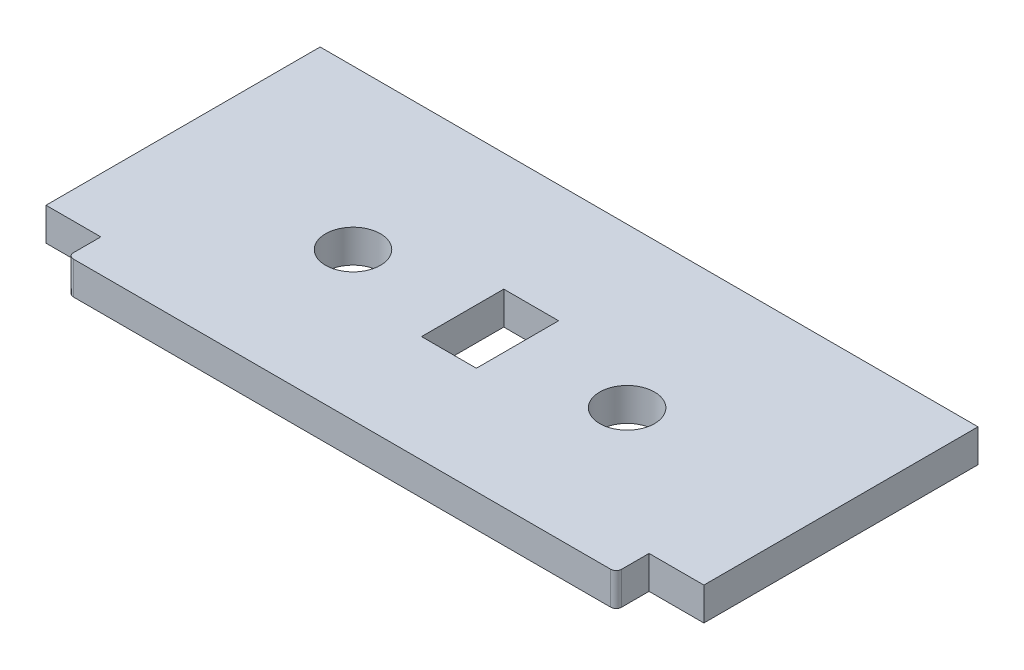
ISO-10303-21;
HEADER;
FILE_DESCRIPTION(('STEP AP214'),'2;1');
FILE_NAME('part.step','',(''),(''),'','','');
FILE_SCHEMA(('AUTOMOTIVE_DESIGN { 1 0 10303 214 1 1 1 1 }'));
ENDSEC;
DATA;
#1=APPLICATION_CONTEXT('core data for automotive mechanical design processes');
#2=APPLICATION_PROTOCOL_DEFINITION('international standard','automotive_design',2000,#1);
#3=PRODUCT_CONTEXT('',#1,'mechanical');
#4=PRODUCT('Part','Part','',(#3));
#5=PRODUCT_RELATED_PRODUCT_CATEGORY('part','',(#4));
#6=PRODUCT_DEFINITION_FORMATION('','',#4);
#7=PRODUCT_DEFINITION_CONTEXT('part definition',#1,'design');
#8=PRODUCT_DEFINITION('design','',#6,#7);
#9=PRODUCT_DEFINITION_SHAPE('','',#8);
#10=(LENGTH_UNIT() NAMED_UNIT(*) SI_UNIT(.MILLI.,.METRE.));
#11=(NAMED_UNIT(*) PLANE_ANGLE_UNIT() SI_UNIT($,.RADIAN.));
#12=(NAMED_UNIT(*) SI_UNIT($,.STERADIAN.) SOLID_ANGLE_UNIT());
#13=UNCERTAINTY_MEASURE_WITH_UNIT(LENGTH_MEASURE(1.E-05),#10,'distance_accuracy_value','');
#14=(GEOMETRIC_REPRESENTATION_CONTEXT(3) GLOBAL_UNCERTAINTY_ASSIGNED_CONTEXT((#13)) GLOBAL_UNIT_ASSIGNED_CONTEXT((#10,
#11,#12)) REPRESENTATION_CONTEXT('',''));
#15=CARTESIAN_POINT('',(0.,0.,0.));
#16=DIRECTION('',(0.,0.,1.));
#17=DIRECTION('',(1.,0.,0.));
#18=AXIS2_PLACEMENT_3D('',#15,#16,#17);
#19=CARTESIAN_POINT('',(0.,6.,0.));
#20=DIRECTION('',(0.,-1.,0.));
#21=DIRECTION('',(0.,0.,-1.));
#22=AXIS2_PLACEMENT_3D('',#19,#20,#21);
#23=PLANE('',#22);
#24=CARTESIAN_POINT('',(25.,6.,4.));
#25=DIRECTION('',(0.,1.,0.));
#26=DIRECTION('',(0.,0.,-1.));
#27=AXIS2_PLACEMENT_3D('',#24,#25,#26);
#28=CIRCLE('',#27,5.);
#29=CARTESIAN_POINT('',(25.,6.,-1.));
#30=VERTEX_POINT('',#29);
#31=EDGE_CURVE('E202',#30,#30,#28,.T.);
#32=ORIENTED_EDGE('',*,*,#31,.F.);
#33=EDGE_LOOP('',(#32));
#34=FACE_BOUND('',#33,.T.);
#35=CARTESIAN_POINT('',(-25.,6.,4.));
#36=DIRECTION('',(0.,1.,0.));
#37=DIRECTION('',(0.,0.,1.));
#38=AXIS2_PLACEMENT_3D('',#35,#36,#37);
#39=CIRCLE('',#38,5.);
#40=CARTESIAN_POINT('',(-25.,6.,9.));
#41=VERTEX_POINT('',#40);
#42=EDGE_CURVE('E210',#41,#41,#39,.T.);
#43=ORIENTED_EDGE('',*,*,#42,.F.);
#44=EDGE_LOOP('',(#43));
#45=FACE_BOUND('',#44,.T.);
#46=DIRECTION('',(0.,0.,1.));
#47=VECTOR('',#46,1.);
#48=CARTESIAN_POINT('',(-50.,6.,25.));
#49=LINE('',#48,#47);
#50=CARTESIAN_POINT('',(-50.,6.,25.));
#51=VERTEX_POINT('',#50);
#52=CARTESIAN_POINT('',(-50.,6.,30.));
#53=VERTEX_POINT('',#52);
#54=EDGE_CURVE('E235',#51,#53,#49,.T.);
#55=ORIENTED_EDGE('',*,*,#54,.T.);
#56=CARTESIAN_POINT('',(-49.,6.,30.));
#57=DIRECTION('',(0.,-1.,0.));
#58=DIRECTION('',(0.,0.,-1.));
#59=AXIS2_PLACEMENT_3D('',#56,#57,#58);
#60=CIRCLE('',#59,1.);
#61=CARTESIAN_POINT('',(-49.,6.,31.));
#62=VERTEX_POINT('',#61);
#63=EDGE_CURVE('E52',#53,#62,#60,.F.);
#64=ORIENTED_EDGE('',*,*,#63,.T.);
#65=DIRECTION('',(1.,0.,0.));
#66=VECTOR('',#65,1.);
#67=CARTESIAN_POINT('',(-50.,6.,31.));
#68=LINE('',#67,#66);
#69=CARTESIAN_POINT('',(49.,6.,31.));
#70=VERTEX_POINT('',#69);
#71=EDGE_CURVE('E238',#62,#70,#68,.T.);
#72=ORIENTED_EDGE('',*,*,#71,.T.);
#73=CARTESIAN_POINT('',(49.,6.,30.));
#74=DIRECTION('',(0.,-1.,0.));
#75=DIRECTION('',(0.,0.,-1.));
#76=AXIS2_PLACEMENT_3D('',#73,#74,#75);
#77=CIRCLE('',#76,1.);
#78=CARTESIAN_POINT('',(50.,6.,30.));
#79=VERTEX_POINT('',#78);
#80=EDGE_CURVE('E59',#70,#79,#77,.F.);
#81=ORIENTED_EDGE('',*,*,#80,.T.);
#82=DIRECTION('',(0.,0.,-1.));
#83=VECTOR('',#82,1.);
#84=CARTESIAN_POINT('',(50.,6.,31.));
#85=LINE('',#84,#83);
#86=CARTESIAN_POINT('',(50.,6.,25.));
#87=VERTEX_POINT('',#86);
#88=EDGE_CURVE('E241',#79,#87,#85,.T.);
#89=ORIENTED_EDGE('',*,*,#88,.T.);
#90=DIRECTION('',(1.,0.,0.));
#91=VECTOR('',#90,1.);
#92=CARTESIAN_POINT('',(50.,6.,25.));
#93=LINE('',#92,#91);
#94=CARTESIAN_POINT('',(60.,6.,25.));
#95=VERTEX_POINT('',#94);
#96=EDGE_CURVE('E218',#87,#95,#93,.T.);
#97=ORIENTED_EDGE('',*,*,#96,.T.);
#98=DIRECTION('',(0.,0.,-1.));
#99=VECTOR('',#98,1.);
#100=CARTESIAN_POINT('',(60.,6.,-25.));
#101=LINE('',#100,#99);
#102=CARTESIAN_POINT('',(60.,6.,-25.));
#103=VERTEX_POINT('',#102);
#104=EDGE_CURVE('E222',#95,#103,#101,.T.);
#105=ORIENTED_EDGE('',*,*,#104,.T.);
#106=DIRECTION('',(-1.,0.,0.));
#107=VECTOR('',#106,1.);
#108=CARTESIAN_POINT('',(-60.,6.,-25.));
#109=LINE('',#108,#107);
#110=CARTESIAN_POINT('',(-60.,6.,-25.));
#111=VERTEX_POINT('',#110);
#112=EDGE_CURVE('E226',#103,#111,#109,.T.);
#113=ORIENTED_EDGE('',*,*,#112,.T.);
#114=DIRECTION('',(0.,0.,1.));
#115=VECTOR('',#114,1.);
#116=CARTESIAN_POINT('',(-60.,6.,-25.));
#117=LINE('',#116,#115);
#118=CARTESIAN_POINT('',(-60.,6.,25.));
#119=VERTEX_POINT('',#118);
#120=EDGE_CURVE('E229',#111,#119,#117,.T.);
#121=ORIENTED_EDGE('',*,*,#120,.T.);
#122=DIRECTION('',(1.,0.,0.));
#123=VECTOR('',#122,1.);
#124=CARTESIAN_POINT('',(-60.,6.,25.));
#125=LINE('',#124,#123);
#126=EDGE_CURVE('E232',#119,#51,#125,.T.);
#127=ORIENTED_EDGE('',*,*,#126,.T.);
#128=EDGE_LOOP('',(#55,#64,#72,#81,#89,#97,#105,#113,#121,#127));
#129=FACE_BOUND('',#128,.T.);
#130=DIRECTION('',(0.,0.,-1.));
#131=VECTOR('',#130,1.);
#132=CARTESIAN_POINT('',(5.,6.,-3.5));
#133=LINE('',#132,#131);
#134=CARTESIAN_POINT('',(5.00000000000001,6.,11.5));
#135=VERTEX_POINT('',#134);
#136=CARTESIAN_POINT('',(5.,6.,-3.5));
#137=VERTEX_POINT('',#136);
#138=EDGE_CURVE('E149',#135,#137,#133,.T.);
#139=ORIENTED_EDGE('',*,*,#138,.F.);
#140=DIRECTION('',(1.,0.,0.));
#141=VECTOR('',#140,1.);
#142=CARTESIAN_POINT('',(-5.,6.,11.5));
#143=LINE('',#142,#141);
#144=CARTESIAN_POINT('',(-5.,6.,11.5));
#145=VERTEX_POINT('',#144);
#146=EDGE_CURVE('E178',#145,#135,#143,.T.);
#147=ORIENTED_EDGE('',*,*,#146,.F.);
#148=DIRECTION('',(0.,0.,1.));
#149=VECTOR('',#148,1.);
#150=CARTESIAN_POINT('',(-5.,6.,-3.5));
#151=LINE('',#150,#149);
#152=CARTESIAN_POINT('',(-5.,6.,-3.5));
#153=VERTEX_POINT('',#152);
#154=EDGE_CURVE('E174',#153,#145,#151,.T.);
#155=ORIENTED_EDGE('',*,*,#154,.F.);
#156=DIRECTION('',(-1.,0.,0.));
#157=VECTOR('',#156,1.);
#158=CARTESIAN_POINT('',(-5.,6.,-3.5));
#159=LINE('',#158,#157);
#160=EDGE_CURVE('E160',#137,#153,#159,.T.);
#161=ORIENTED_EDGE('',*,*,#160,.F.);
#162=EDGE_LOOP('',(#139,#147,#155,#161));
#163=FACE_BOUND('',#162,.T.);
#164=ADVANCED_FACE('F43',(#34,#45,#129,#163),#23,.F.);
#165=CARTESIAN_POINT('',(0.,0.,0.));
#166=DIRECTION('',(0.,-1.,0.));
#167=DIRECTION('',(0.,0.,-1.));
#168=AXIS2_PLACEMENT_3D('',#165,#166,#167);
#169=PLANE('',#168);
#170=CARTESIAN_POINT('',(-25.,0.,4.));
#171=DIRECTION('',(0.,1.,0.));
#172=DIRECTION('',(0.,0.,1.));
#173=AXIS2_PLACEMENT_3D('',#170,#171,#172);
#174=CIRCLE('',#173,5.);
#175=CARTESIAN_POINT('',(-25.,0.,9.));
#176=VERTEX_POINT('',#175);
#177=EDGE_CURVE('E206',#176,#176,#174,.T.);
#178=ORIENTED_EDGE('',*,*,#177,.T.);
#179=EDGE_LOOP('',(#178));
#180=FACE_BOUND('',#179,.T.);
#181=DIRECTION('',(1.,0.,0.));
#182=VECTOR('',#181,1.);
#183=CARTESIAN_POINT('',(-50.,0.,31.));
#184=LINE('',#183,#182);
#185=CARTESIAN_POINT('',(-49.,0.,31.));
#186=VERTEX_POINT('',#185);
#187=CARTESIAN_POINT('',(49.,0.,31.));
#188=VERTEX_POINT('',#187);
#189=EDGE_CURVE('E263',#186,#188,#184,.T.);
#190=ORIENTED_EDGE('',*,*,#189,.F.);
#191=CARTESIAN_POINT('',(-49.,0.,30.));
#192=DIRECTION('',(0.,-1.,0.));
#193=DIRECTION('',(0.,0.,-1.));
#194=AXIS2_PLACEMENT_3D('',#191,#192,#193);
#195=CIRCLE('',#194,1.);
#196=CARTESIAN_POINT('',(-50.,0.,30.));
#197=VERTEX_POINT('',#196);
#198=EDGE_CURVE('E302',#186,#197,#195,.T.);
#199=ORIENTED_EDGE('',*,*,#198,.T.);
#200=DIRECTION('',(0.,0.,1.));
#201=VECTOR('',#200,1.);
#202=CARTESIAN_POINT('',(-50.,0.,25.));
#203=LINE('',#202,#201);
#204=CARTESIAN_POINT('',(-50.,0.,25.));
#205=VERTEX_POINT('',#204);
#206=EDGE_CURVE('E260',#205,#197,#203,.T.);
#207=ORIENTED_EDGE('',*,*,#206,.F.);
#208=DIRECTION('',(1.,0.,0.));
#209=VECTOR('',#208,1.);
#210=CARTESIAN_POINT('',(-60.,0.,25.));
#211=LINE('',#210,#209);
#212=CARTESIAN_POINT('',(-60.,0.,25.));
#213=VERTEX_POINT('',#212);
#214=EDGE_CURVE('E257',#213,#205,#211,.T.);
#215=ORIENTED_EDGE('',*,*,#214,.F.);
#216=DIRECTION('',(0.,0.,1.));
#217=VECTOR('',#216,1.);
#218=CARTESIAN_POINT('',(-60.,0.,-25.));
#219=LINE('',#218,#217);
#220=CARTESIAN_POINT('',(-60.,0.,-25.));
#221=VERTEX_POINT('',#220);
#222=EDGE_CURVE('E254',#221,#213,#219,.T.);
#223=ORIENTED_EDGE('',*,*,#222,.F.);
#224=DIRECTION('',(-1.,0.,0.));
#225=VECTOR('',#224,1.);
#226=CARTESIAN_POINT('',(-60.,0.,-25.));
#227=LINE('',#226,#225);
#228=CARTESIAN_POINT('',(60.,0.,-25.));
#229=VERTEX_POINT('',#228);
#230=EDGE_CURVE('E251',#229,#221,#227,.T.);
#231=ORIENTED_EDGE('',*,*,#230,.F.);
#232=DIRECTION('',(0.,0.,-1.));
#233=VECTOR('',#232,1.);
#234=CARTESIAN_POINT('',(60.,0.,-25.));
#235=LINE('',#234,#233);
#236=CARTESIAN_POINT('',(60.,0.,25.));
#237=VERTEX_POINT('',#236);
#238=EDGE_CURVE('E248',#237,#229,#235,.T.);
#239=ORIENTED_EDGE('',*,*,#238,.F.);
#240=DIRECTION('',(1.,0.,0.));
#241=VECTOR('',#240,1.);
#242=CARTESIAN_POINT('',(50.,0.,25.));
#243=LINE('',#242,#241);
#244=CARTESIAN_POINT('',(50.,0.,25.));
#245=VERTEX_POINT('',#244);
#246=EDGE_CURVE('E214',#245,#237,#243,.T.);
#247=ORIENTED_EDGE('',*,*,#246,.F.);
#248=DIRECTION('',(0.,0.,-1.));
#249=VECTOR('',#248,1.);
#250=CARTESIAN_POINT('',(50.,0.,31.));
#251=LINE('',#250,#249);
#252=CARTESIAN_POINT('',(50.,0.,30.));
#253=VERTEX_POINT('',#252);
#254=EDGE_CURVE('E223',#253,#245,#251,.T.);
#255=ORIENTED_EDGE('',*,*,#254,.F.);
#256=CARTESIAN_POINT('',(49.,0.,30.));
#257=DIRECTION('',(0.,-1.,0.));
#258=DIRECTION('',(0.,0.,-1.));
#259=AXIS2_PLACEMENT_3D('',#256,#257,#258);
#260=CIRCLE('',#259,1.);
#261=EDGE_CURVE('E299',#253,#188,#260,.T.);
#262=ORIENTED_EDGE('',*,*,#261,.T.);
#263=EDGE_LOOP('',(#190,#199,#207,#215,#223,#231,#239,#247,#255,#262));
#264=FACE_BOUND('',#263,.T.);
#265=CARTESIAN_POINT('',(25.,0.,4.));
#266=DIRECTION('',(0.,1.,0.));
#267=DIRECTION('',(0.,0.,-1.));
#268=AXIS2_PLACEMENT_3D('',#265,#266,#267);
#269=CIRCLE('',#268,5.);
#270=CARTESIAN_POINT('',(25.,0.,-1.));
#271=VERTEX_POINT('',#270);
#272=EDGE_CURVE('E169',#271,#271,#269,.T.);
#273=ORIENTED_EDGE('',*,*,#272,.T.);
#274=EDGE_LOOP('',(#273));
#275=FACE_BOUND('',#274,.T.);
#276=DIRECTION('',(1.,0.,0.));
#277=VECTOR('',#276,1.);
#278=CARTESIAN_POINT('',(-5.,0.,11.5));
#279=LINE('',#278,#277);
#280=CARTESIAN_POINT('',(-5.,0.,11.5));
#281=VERTEX_POINT('',#280);
#282=CARTESIAN_POINT('',(5.00000000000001,0.,11.5));
#283=VERTEX_POINT('',#282);
#284=EDGE_CURVE('E161',#281,#283,#279,.T.);
#285=ORIENTED_EDGE('',*,*,#284,.T.);
#286=DIRECTION('',(0.,0.,-1.));
#287=VECTOR('',#286,1.);
#288=CARTESIAN_POINT('',(5.,0.,-3.5));
#289=LINE('',#288,#287);
#290=CARTESIAN_POINT('',(5.,0.,-3.5));
#291=VERTEX_POINT('',#290);
#292=EDGE_CURVE('E183',#283,#291,#289,.T.);
#293=ORIENTED_EDGE('',*,*,#292,.T.);
#294=DIRECTION('',(-1.,0.,0.));
#295=VECTOR('',#294,1.);
#296=CARTESIAN_POINT('',(-5.,0.,-3.5));
#297=LINE('',#296,#295);
#298=CARTESIAN_POINT('',(-5.,0.,-3.5));
#299=VERTEX_POINT('',#298);
#300=EDGE_CURVE('E167',#291,#299,#297,.T.);
#301=ORIENTED_EDGE('',*,*,#300,.T.);
#302=DIRECTION('',(0.,0.,1.));
#303=VECTOR('',#302,1.);
#304=CARTESIAN_POINT('',(-5.,0.,-3.5));
#305=LINE('',#304,#303);
#306=EDGE_CURVE('E188',#299,#281,#305,.T.);
#307=ORIENTED_EDGE('',*,*,#306,.T.);
#308=EDGE_LOOP('',(#285,#293,#301,#307));
#309=FACE_BOUND('',#308,.T.);
#310=ADVANCED_FACE('F320',(#180,#264,#275,#309),#169,.T.);
#311=CARTESIAN_POINT('',(50.,6.,25.));
#312=DIRECTION('',(0.,0.,-1.));
#313=DIRECTION('',(-1.,0.,0.));
#314=AXIS2_PLACEMENT_3D('',#311,#312,#313);
#315=PLANE('',#314);
#316=ORIENTED_EDGE('',*,*,#246,.T.);
#317=DIRECTION('',(0.,-1.,0.));
#318=VECTOR('',#317,1.);
#319=CARTESIAN_POINT('',(60.,6.,25.));
#320=LINE('',#319,#318);
#321=EDGE_CURVE('E288',#95,#237,#320,.T.);
#322=ORIENTED_EDGE('',*,*,#321,.F.);
#323=ORIENTED_EDGE('',*,*,#96,.F.);
#324=DIRECTION('',(0.,-1.,0.));
#325=VECTOR('',#324,1.);
#326=CARTESIAN_POINT('',(50.,6.,25.));
#327=LINE('',#326,#325);
#328=EDGE_CURVE('E244',#87,#245,#327,.T.);
#329=ORIENTED_EDGE('',*,*,#328,.T.);
#330=EDGE_LOOP('',(#316,#322,#323,#329));
#331=FACE_BOUND('',#330,.T.);
#332=ADVANCED_FACE('F345',(#331),#315,.F.);
#333=CARTESIAN_POINT('',(60.,6.,-25.));
#334=DIRECTION('',(-1.,0.,0.));
#335=DIRECTION('',(0.,0.,1.));
#336=AXIS2_PLACEMENT_3D('',#333,#334,#335);
#337=PLANE('',#336);
#338=ORIENTED_EDGE('',*,*,#238,.T.);
#339=DIRECTION('',(0.,-1.,0.));
#340=VECTOR('',#339,1.);
#341=CARTESIAN_POINT('',(60.,6.,-25.));
#342=LINE('',#341,#340);
#343=EDGE_CURVE('E284',#103,#229,#342,.T.);
#344=ORIENTED_EDGE('',*,*,#343,.F.);
#345=ORIENTED_EDGE('',*,*,#104,.F.);
#346=ORIENTED_EDGE('',*,*,#321,.T.);
#347=EDGE_LOOP('',(#338,#344,#345,#346));
#348=FACE_BOUND('',#347,.T.);
#349=ADVANCED_FACE('F340',(#348),#337,.F.);
#350=CARTESIAN_POINT('',(-60.,6.,-25.));
#351=DIRECTION('',(0.,0.,1.));
#352=DIRECTION('',(1.,0.,0.));
#353=AXIS2_PLACEMENT_3D('',#350,#351,#352);
#354=PLANE('',#353);
#355=ORIENTED_EDGE('',*,*,#230,.T.);
#356=DIRECTION('',(0.,-1.,0.));
#357=VECTOR('',#356,1.);
#358=CARTESIAN_POINT('',(-60.,6.,-25.));
#359=LINE('',#358,#357);
#360=EDGE_CURVE('E280',#111,#221,#359,.T.);
#361=ORIENTED_EDGE('',*,*,#360,.F.);
#362=ORIENTED_EDGE('',*,*,#112,.F.);
#363=ORIENTED_EDGE('',*,*,#343,.T.);
#364=EDGE_LOOP('',(#355,#361,#362,#363));
#365=FACE_BOUND('',#364,.T.);
#366=ADVANCED_FACE('F337',(#365),#354,.F.);
#367=CARTESIAN_POINT('',(-60.,6.,-25.));
#368=DIRECTION('',(1.,0.,0.));
#369=DIRECTION('',(0.,0.,-1.));
#370=AXIS2_PLACEMENT_3D('',#367,#368,#369);
#371=PLANE('',#370);
#372=ORIENTED_EDGE('',*,*,#222,.T.);
#373=DIRECTION('',(0.,-1.,0.));
#374=VECTOR('',#373,1.);
#375=CARTESIAN_POINT('',(-60.,6.,25.));
#376=LINE('',#375,#374);
#377=EDGE_CURVE('E276',#119,#213,#376,.T.);
#378=ORIENTED_EDGE('',*,*,#377,.F.);
#379=ORIENTED_EDGE('',*,*,#120,.F.);
#380=ORIENTED_EDGE('',*,*,#360,.T.);
#381=EDGE_LOOP('',(#372,#378,#379,#380));
#382=FACE_BOUND('',#381,.T.);
#383=ADVANCED_FACE('F332',(#382),#371,.F.);
#384=CARTESIAN_POINT('',(-60.,6.,25.));
#385=DIRECTION('',(0.,0.,-1.));
#386=DIRECTION('',(-1.,0.,0.));
#387=AXIS2_PLACEMENT_3D('',#384,#385,#386);
#388=PLANE('',#387);
#389=ORIENTED_EDGE('',*,*,#214,.T.);
#390=DIRECTION('',(0.,-1.,0.));
#391=VECTOR('',#390,1.);
#392=CARTESIAN_POINT('',(-50.,6.,25.));
#393=LINE('',#392,#391);
#394=EDGE_CURVE('E272',#51,#205,#393,.T.);
#395=ORIENTED_EDGE('',*,*,#394,.F.);
#396=ORIENTED_EDGE('',*,*,#126,.F.);
#397=ORIENTED_EDGE('',*,*,#377,.T.);
#398=EDGE_LOOP('',(#389,#395,#396,#397));
#399=FACE_BOUND('',#398,.T.);
#400=ADVANCED_FACE('F327',(#399),#388,.F.);
#401=CARTESIAN_POINT('',(-50.,6.,25.));
#402=DIRECTION('',(1.,0.,0.));
#403=DIRECTION('',(0.,0.,-1.));
#404=AXIS2_PLACEMENT_3D('',#401,#402,#403);
#405=PLANE('',#404);
#406=ORIENTED_EDGE('',*,*,#206,.T.);
#407=DIRECTION('',(0.,-1.,0.));
#408=VECTOR('',#407,1.);
#409=CARTESIAN_POINT('',(-50.,6.,30.));
#410=LINE('',#409,#408);
#411=EDGE_CURVE('E67',#197,#53,#410,.F.);
#412=ORIENTED_EDGE('',*,*,#411,.T.);
#413=ORIENTED_EDGE('',*,*,#54,.F.);
#414=ORIENTED_EDGE('',*,*,#394,.T.);
#415=EDGE_LOOP('',(#406,#412,#413,#414));
#416=FACE_BOUND('',#415,.T.);
#417=ADVANCED_FACE('F323',(#416),#405,.F.);
#418=CARTESIAN_POINT('',(-50.,6.,31.));
#419=DIRECTION('',(0.,0.,-1.));
#420=DIRECTION('',(-1.,0.,0.));
#421=AXIS2_PLACEMENT_3D('',#418,#419,#420);
#422=PLANE('',#421);
#423=ORIENTED_EDGE('',*,*,#71,.F.);
#424=DIRECTION('',(0.,-1.,0.));
#425=VECTOR('',#424,1.);
#426=CARTESIAN_POINT('',(-49.,6.,31.));
#427=LINE('',#426,#425);
#428=EDGE_CURVE('E295',#62,#186,#427,.T.);
#429=ORIENTED_EDGE('',*,*,#428,.T.);
#430=ORIENTED_EDGE('',*,*,#189,.T.);
#431=DIRECTION('',(0.,-1.,0.));
#432=VECTOR('',#431,1.);
#433=CARTESIAN_POINT('',(49.,6.,31.));
#434=LINE('',#433,#432);
#435=EDGE_CURVE('E292',#188,#70,#434,.F.);
#436=ORIENTED_EDGE('',*,*,#435,.T.);
#437=EDGE_LOOP('',(#423,#429,#430,#436));
#438=FACE_BOUND('',#437,.T.);
#439=ADVANCED_FACE('F314',(#438),#422,.F.);
#440=CARTESIAN_POINT('',(50.,6.,31.));
#441=DIRECTION('',(-1.,0.,0.));
#442=DIRECTION('',(0.,0.,1.));
#443=AXIS2_PLACEMENT_3D('',#440,#441,#442);
#444=PLANE('',#443);
#445=ORIENTED_EDGE('',*,*,#88,.F.);
#446=DIRECTION('',(0.,-1.,0.));
#447=VECTOR('',#446,1.);
#448=CARTESIAN_POINT('',(50.,6.,30.));
#449=LINE('',#448,#447);
#450=EDGE_CURVE('E11',#79,#253,#449,.T.);
#451=ORIENTED_EDGE('',*,*,#450,.T.);
#452=ORIENTED_EDGE('',*,*,#254,.T.);
#453=ORIENTED_EDGE('',*,*,#328,.F.);
#454=EDGE_LOOP('',(#445,#451,#452,#453));
#455=FACE_BOUND('',#454,.T.);
#456=ADVANCED_FACE('F349',(#455),#444,.F.);
#457=CARTESIAN_POINT('',(-25.,6.,4.));
#458=DIRECTION('',(0.,-1.,0.));
#459=DIRECTION('',(0.,0.,-1.));
#460=AXIS2_PLACEMENT_3D('',#457,#458,#459);
#461=CYLINDRICAL_SURFACE('',#460,5.);
#462=ORIENTED_EDGE('',*,*,#42,.T.);
#463=EDGE_LOOP('',(#462));
#464=FACE_BOUND('',#463,.T.);
#465=ORIENTED_EDGE('',*,*,#177,.F.);
#466=EDGE_LOOP('',(#465));
#467=FACE_BOUND('',#466,.T.);
#468=ADVANCED_FACE('F368',(#464,#467),#461,.F.);
#469=CARTESIAN_POINT('',(25.,6.,4.));
#470=DIRECTION('',(0.,-1.,0.));
#471=DIRECTION('',(0.,0.,-1.));
#472=AXIS2_PLACEMENT_3D('',#469,#470,#471);
#473=CYLINDRICAL_SURFACE('',#472,5.);
#474=ORIENTED_EDGE('',*,*,#31,.T.);
#475=EDGE_LOOP('',(#474));
#476=FACE_BOUND('',#475,.T.);
#477=ORIENTED_EDGE('',*,*,#272,.F.);
#478=EDGE_LOOP('',(#477));
#479=FACE_BOUND('',#478,.T.);
#480=ADVANCED_FACE('F425',(#476,#479),#473,.F.);
#481=CARTESIAN_POINT('',(5.,6.,-3.5));
#482=DIRECTION('',(-1.,0.,0.));
#483=DIRECTION('',(0.,0.,1.));
#484=AXIS2_PLACEMENT_3D('',#481,#482,#483);
#485=PLANE('',#484);
#486=ORIENTED_EDGE('',*,*,#292,.F.);
#487=DIRECTION('',(0.,-1.,0.));
#488=VECTOR('',#487,1.);
#489=CARTESIAN_POINT('',(5.00000000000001,6.,11.5));
#490=LINE('',#489,#488);
#491=EDGE_CURVE('E155',#135,#283,#490,.T.);
#492=ORIENTED_EDGE('',*,*,#491,.F.);
#493=ORIENTED_EDGE('',*,*,#138,.T.);
#494=DIRECTION('',(0.,-1.,0.));
#495=VECTOR('',#494,1.);
#496=CARTESIAN_POINT('',(5.,6.,-3.5));
#497=LINE('',#496,#495);
#498=EDGE_CURVE('E152',#137,#291,#497,.T.);
#499=ORIENTED_EDGE('',*,*,#498,.T.);
#500=EDGE_LOOP('',(#486,#492,#493,#499));
#501=FACE_BOUND('',#500,.T.);
#502=ADVANCED_FACE('F151',(#501),#485,.T.);
#503=CARTESIAN_POINT('',(-5.,6.,-3.5));
#504=DIRECTION('',(0.,0.,1.));
#505=DIRECTION('',(1.,0.,0.));
#506=AXIS2_PLACEMENT_3D('',#503,#504,#505);
#507=PLANE('',#506);
#508=ORIENTED_EDGE('',*,*,#300,.F.);
#509=ORIENTED_EDGE('',*,*,#498,.F.);
#510=ORIENTED_EDGE('',*,*,#160,.T.);
#511=DIRECTION('',(0.,-1.,0.));
#512=VECTOR('',#511,1.);
#513=CARTESIAN_POINT('',(-5.,6.,-3.5));
#514=LINE('',#513,#512);
#515=EDGE_CURVE('E170',#153,#299,#514,.T.);
#516=ORIENTED_EDGE('',*,*,#515,.T.);
#517=EDGE_LOOP('',(#508,#509,#510,#516));
#518=FACE_BOUND('',#517,.T.);
#519=ADVANCED_FACE('F164',(#518),#507,.T.);
#520=CARTESIAN_POINT('',(-5.,6.,-3.5));
#521=DIRECTION('',(1.,0.,0.));
#522=DIRECTION('',(0.,0.,-1.));
#523=AXIS2_PLACEMENT_3D('',#520,#521,#522);
#524=PLANE('',#523);
#525=ORIENTED_EDGE('',*,*,#306,.F.);
#526=ORIENTED_EDGE('',*,*,#515,.F.);
#527=ORIENTED_EDGE('',*,*,#154,.T.);
#528=DIRECTION('',(0.,-1.,0.));
#529=VECTOR('',#528,1.);
#530=CARTESIAN_POINT('',(-5.,6.,11.5));
#531=LINE('',#530,#529);
#532=EDGE_CURVE('E197',#145,#281,#531,.T.);
#533=ORIENTED_EDGE('',*,*,#532,.T.);
#534=EDGE_LOOP('',(#525,#526,#527,#533));
#535=FACE_BOUND('',#534,.T.);
#536=ADVANCED_FACE('F444',(#535),#524,.T.);
#537=CARTESIAN_POINT('',(-5.,6.,11.5));
#538=DIRECTION('',(0.,0.,-1.));
#539=DIRECTION('',(-1.,0.,0.));
#540=AXIS2_PLACEMENT_3D('',#537,#538,#539);
#541=PLANE('',#540);
#542=ORIENTED_EDGE('',*,*,#284,.F.);
#543=ORIENTED_EDGE('',*,*,#532,.F.);
#544=ORIENTED_EDGE('',*,*,#146,.T.);
#545=ORIENTED_EDGE('',*,*,#491,.T.);
#546=EDGE_LOOP('',(#542,#543,#544,#545));
#547=FACE_BOUND('',#546,.T.);
#548=ADVANCED_FACE('F356',(#547),#541,.T.);
#549=CARTESIAN_POINT('',(-49.,6.,30.));
#550=DIRECTION('',(0.,-1.,0.));
#551=DIRECTION('',(0.,0.,-1.));
#552=AXIS2_PLACEMENT_3D('',#549,#550,#551);
#553=CYLINDRICAL_SURFACE('',#552,1.);
#554=ORIENTED_EDGE('',*,*,#63,.F.);
#555=ORIENTED_EDGE('',*,*,#411,.F.);
#556=ORIENTED_EDGE('',*,*,#198,.F.);
#557=ORIENTED_EDGE('',*,*,#428,.F.);
#558=EDGE_LOOP('',(#554,#555,#556,#557));
#559=FACE_BOUND('',#558,.T.);
#560=ADVANCED_FACE('F317',(#559),#553,.T.);
#561=CARTESIAN_POINT('',(49.,6.,30.));
#562=DIRECTION('',(0.,-1.,0.));
#563=DIRECTION('',(0.,0.,-1.));
#564=AXIS2_PLACEMENT_3D('',#561,#562,#563);
#565=CYLINDRICAL_SURFACE('',#564,1.);
#566=ORIENTED_EDGE('',*,*,#80,.F.);
#567=ORIENTED_EDGE('',*,*,#435,.F.);
#568=ORIENTED_EDGE('',*,*,#261,.F.);
#569=ORIENTED_EDGE('',*,*,#450,.F.);
#570=EDGE_LOOP('',(#566,#567,#568,#569));
#571=FACE_BOUND('',#570,.T.);
#572=ADVANCED_FACE('F45',(#571),#565,.T.);
#573=CLOSED_SHELL('',(#164,#310,#332,#349,#366,#383,#400,#417,#439,#456,#468,#480,#502,#519,
#536,#548,#560,#572));
#574=MANIFOLD_SOLID_BREP('B2',#573);
#575=ADVANCED_BREP_SHAPE_REPRESENTATION('',(#18,#574),#14);
#576=SHAPE_DEFINITION_REPRESENTATION(#9,#575);
ENDSEC;
END-ISO-10303-21;
